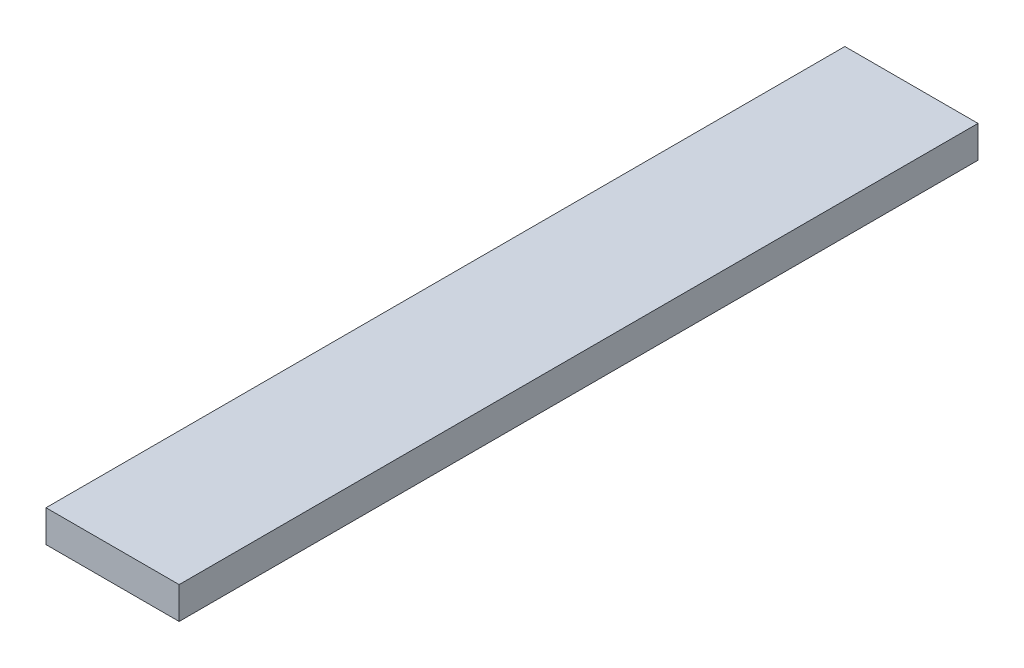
ISO-10303-21;
HEADER;
FILE_DESCRIPTION(('STEP AP214'),'2;1');
FILE_NAME('part.step','',(''),(''),'','','');
FILE_SCHEMA(('AUTOMOTIVE_DESIGN { 1 0 10303 214 1 1 1 1 }'));
ENDSEC;
DATA;
#1=APPLICATION_CONTEXT('core data for automotive mechanical design processes');
#2=APPLICATION_PROTOCOL_DEFINITION('international standard','automotive_design',2000,#1);
#3=PRODUCT_CONTEXT('',#1,'mechanical');
#4=PRODUCT('Part','Part','',(#3));
#5=PRODUCT_RELATED_PRODUCT_CATEGORY('part','',(#4));
#6=PRODUCT_DEFINITION_FORMATION('','',#4);
#7=PRODUCT_DEFINITION_CONTEXT('part definition',#1,'design');
#8=PRODUCT_DEFINITION('design','',#6,#7);
#9=PRODUCT_DEFINITION_SHAPE('','',#8);
#10=(LENGTH_UNIT() NAMED_UNIT(*) SI_UNIT(.MILLI.,.METRE.));
#11=(NAMED_UNIT(*) PLANE_ANGLE_UNIT() SI_UNIT($,.RADIAN.));
#12=(NAMED_UNIT(*) SI_UNIT($,.STERADIAN.) SOLID_ANGLE_UNIT());
#13=UNCERTAINTY_MEASURE_WITH_UNIT(LENGTH_MEASURE(1.E-05),#10,'distance_accuracy_value','');
#14=(GEOMETRIC_REPRESENTATION_CONTEXT(3) GLOBAL_UNCERTAINTY_ASSIGNED_CONTEXT((#13)) GLOBAL_UNIT_ASSIGNED_CONTEXT((#10,
#11,#12)) REPRESENTATION_CONTEXT('',''));
#15=CARTESIAN_POINT('',(0.,0.,0.));
#16=DIRECTION('',(0.,0.,1.));
#17=DIRECTION('',(1.,0.,0.));
#18=AXIS2_PLACEMENT_3D('',#15,#16,#17);
#19=CARTESIAN_POINT('',(25.,6.,150.));
#20=DIRECTION('',(-1.,0.,0.));
#21=DIRECTION('',(0.,-1.,0.));
#22=AXIS2_PLACEMENT_3D('',#19,#20,#21);
#23=PLANE('',#22);
#24=DIRECTION('',(0.,1.,0.));
#25=VECTOR('',#24,1.);
#26=CARTESIAN_POINT('',(25.,6.,-150.));
#27=LINE('',#26,#25);
#28=CARTESIAN_POINT('',(25.,-6.,-150.));
#29=VERTEX_POINT('',#28);
#30=CARTESIAN_POINT('',(25.,6.,-150.));
#31=VERTEX_POINT('',#30);
#32=EDGE_CURVE('E99',#29,#31,#27,.T.);
#33=ORIENTED_EDGE('',*,*,#32,.T.);
#34=DIRECTION('',(0.,0.,-1.));
#35=VECTOR('',#34,1.);
#36=CARTESIAN_POINT('',(25.,6.,150.));
#37=LINE('',#36,#35);
#38=CARTESIAN_POINT('',(25.,6.,150.));
#39=VERTEX_POINT('',#38);
#40=EDGE_CURVE('E11',#39,#31,#37,.T.);
#41=ORIENTED_EDGE('',*,*,#40,.F.);
#42=DIRECTION('',(0.,1.,0.));
#43=VECTOR('',#42,1.);
#44=CARTESIAN_POINT('',(25.,6.,150.));
#45=LINE('',#44,#43);
#46=CARTESIAN_POINT('',(25.,-6.,150.));
#47=VERTEX_POINT('',#46);
#48=EDGE_CURVE('E87',#47,#39,#45,.T.);
#49=ORIENTED_EDGE('',*,*,#48,.F.);
#50=DIRECTION('',(0.,0.,-1.));
#51=VECTOR('',#50,1.);
#52=CARTESIAN_POINT('',(25.,-6.,150.));
#53=LINE('',#52,#51);
#54=EDGE_CURVE('E95',#47,#29,#53,.T.);
#55=ORIENTED_EDGE('',*,*,#54,.T.);
#56=EDGE_LOOP('',(#33,#41,#49,#55));
#57=FACE_BOUND('',#56,.T.);
#58=ADVANCED_FACE('F36',(#57),#23,.F.);
#59=CARTESIAN_POINT('',(-25.,6.,150.));
#60=DIRECTION('',(0.,-1.,0.));
#61=DIRECTION('',(0.,0.,-1.));
#62=AXIS2_PLACEMENT_3D('',#59,#60,#61);
#63=PLANE('',#62);
#64=DIRECTION('',(-1.,0.,0.));
#65=VECTOR('',#64,1.);
#66=CARTESIAN_POINT('',(-25.,6.,-150.));
#67=LINE('',#66,#65);
#68=CARTESIAN_POINT('',(-25.,6.,-150.));
#69=VERTEX_POINT('',#68);
#70=EDGE_CURVE('E91',#31,#69,#67,.T.);
#71=ORIENTED_EDGE('',*,*,#70,.T.);
#72=DIRECTION('',(0.,0.,-1.));
#73=VECTOR('',#72,1.);
#74=CARTESIAN_POINT('',(-25.,6.,150.));
#75=LINE('',#74,#73);
#76=CARTESIAN_POINT('',(-25.,6.,150.));
#77=VERTEX_POINT('',#76);
#78=EDGE_CURVE('E44',#77,#69,#75,.T.);
#79=ORIENTED_EDGE('',*,*,#78,.F.);
#80=DIRECTION('',(-1.,0.,0.));
#81=VECTOR('',#80,1.);
#82=CARTESIAN_POINT('',(-25.,6.,150.));
#83=LINE('',#82,#81);
#84=EDGE_CURVE('E82',#39,#77,#83,.T.);
#85=ORIENTED_EDGE('',*,*,#84,.F.);
#86=ORIENTED_EDGE('',*,*,#40,.T.);
#87=EDGE_LOOP('',(#71,#79,#85,#86));
#88=FACE_BOUND('',#87,.T.);
#89=ADVANCED_FACE('F90',(#88),#63,.F.);
#90=CARTESIAN_POINT('',(-25.,6.,150.));
#91=DIRECTION('',(1.,0.,0.));
#92=DIRECTION('',(0.,0.,-1.));
#93=AXIS2_PLACEMENT_3D('',#90,#91,#92);
#94=PLANE('',#93);
#95=DIRECTION('',(0.,-1.,0.));
#96=VECTOR('',#95,1.);
#97=CARTESIAN_POINT('',(-25.,6.,-150.));
#98=LINE('',#97,#96);
#99=CARTESIAN_POINT('',(-25.,-6.,-150.));
#100=VERTEX_POINT('',#99);
#101=EDGE_CURVE('E69',#69,#100,#98,.T.);
#102=ORIENTED_EDGE('',*,*,#101,.T.);
#103=DIRECTION('',(0.,0.,-1.));
#104=VECTOR('',#103,1.);
#105=CARTESIAN_POINT('',(-25.,-6.,150.));
#106=LINE('',#105,#104);
#107=CARTESIAN_POINT('',(-25.,-6.,150.));
#108=VERTEX_POINT('',#107);
#109=EDGE_CURVE('E92',#108,#100,#106,.T.);
#110=ORIENTED_EDGE('',*,*,#109,.F.);
#111=DIRECTION('',(0.,-1.,0.));
#112=VECTOR('',#111,1.);
#113=CARTESIAN_POINT('',(-25.,6.,150.));
#114=LINE('',#113,#112);
#115=EDGE_CURVE('E85',#77,#108,#114,.T.);
#116=ORIENTED_EDGE('',*,*,#115,.F.);
#117=ORIENTED_EDGE('',*,*,#78,.T.);
#118=EDGE_LOOP('',(#102,#110,#116,#117));
#119=FACE_BOUND('',#118,.T.);
#120=ADVANCED_FACE('F93',(#119),#94,.F.);
#121=CARTESIAN_POINT('',(-25.,-6.,150.));
#122=DIRECTION('',(0.,1.,0.));
#123=DIRECTION('',(0.,0.,1.));
#124=AXIS2_PLACEMENT_3D('',#121,#122,#123);
#125=PLANE('',#124);
#126=DIRECTION('',(1.,0.,0.));
#127=VECTOR('',#126,1.);
#128=CARTESIAN_POINT('',(-25.,-6.,-150.));
#129=LINE('',#128,#127);
#130=EDGE_CURVE('E75',#100,#29,#129,.T.);
#131=ORIENTED_EDGE('',*,*,#130,.T.);
#132=ORIENTED_EDGE('',*,*,#54,.F.);
#133=DIRECTION('',(1.,0.,0.));
#134=VECTOR('',#133,1.);
#135=CARTESIAN_POINT('',(-25.,-6.,150.));
#136=LINE('',#135,#134);
#137=EDGE_CURVE('E52',#108,#47,#136,.T.);
#138=ORIENTED_EDGE('',*,*,#137,.F.);
#139=ORIENTED_EDGE('',*,*,#109,.T.);
#140=EDGE_LOOP('',(#131,#132,#138,#139));
#141=FACE_BOUND('',#140,.T.);
#142=ADVANCED_FACE('F106',(#141),#125,.F.);
#143=CARTESIAN_POINT('',(0.,0.,150.));
#144=DIRECTION('',(0.,0.,1.));
#145=DIRECTION('',(1.,0.,0.));
#146=AXIS2_PLACEMENT_3D('',#143,#144,#145);
#147=PLANE('',#146);
#148=ORIENTED_EDGE('',*,*,#48,.T.);
#149=ORIENTED_EDGE('',*,*,#84,.T.);
#150=ORIENTED_EDGE('',*,*,#115,.T.);
#151=ORIENTED_EDGE('',*,*,#137,.T.);
#152=EDGE_LOOP('',(#148,#149,#150,#151));
#153=FACE_BOUND('',#152,.T.);
#154=ADVANCED_FACE('F83',(#153),#147,.T.);
#155=CARTESIAN_POINT('',(0.,0.,-150.));
#156=DIRECTION('',(0.,0.,1.));
#157=DIRECTION('',(1.,0.,0.));
#158=AXIS2_PLACEMENT_3D('',#155,#156,#157);
#159=PLANE('',#158);
#160=ORIENTED_EDGE('',*,*,#32,.F.);
#161=ORIENTED_EDGE('',*,*,#130,.F.);
#162=ORIENTED_EDGE('',*,*,#101,.F.);
#163=ORIENTED_EDGE('',*,*,#70,.F.);
#164=EDGE_LOOP('',(#160,#161,#162,#163));
#165=FACE_BOUND('',#164,.T.);
#166=ADVANCED_FACE('F109',(#165),#159,.F.);
#167=CLOSED_SHELL('',(#58,#89,#120,#142,#154,#166));
#168=MANIFOLD_SOLID_BREP('B2',#167);
#169=ADVANCED_BREP_SHAPE_REPRESENTATION('',(#18,#168),#14);
#170=SHAPE_DEFINITION_REPRESENTATION(#9,#169);
ENDSEC;
END-ISO-10303-21;
